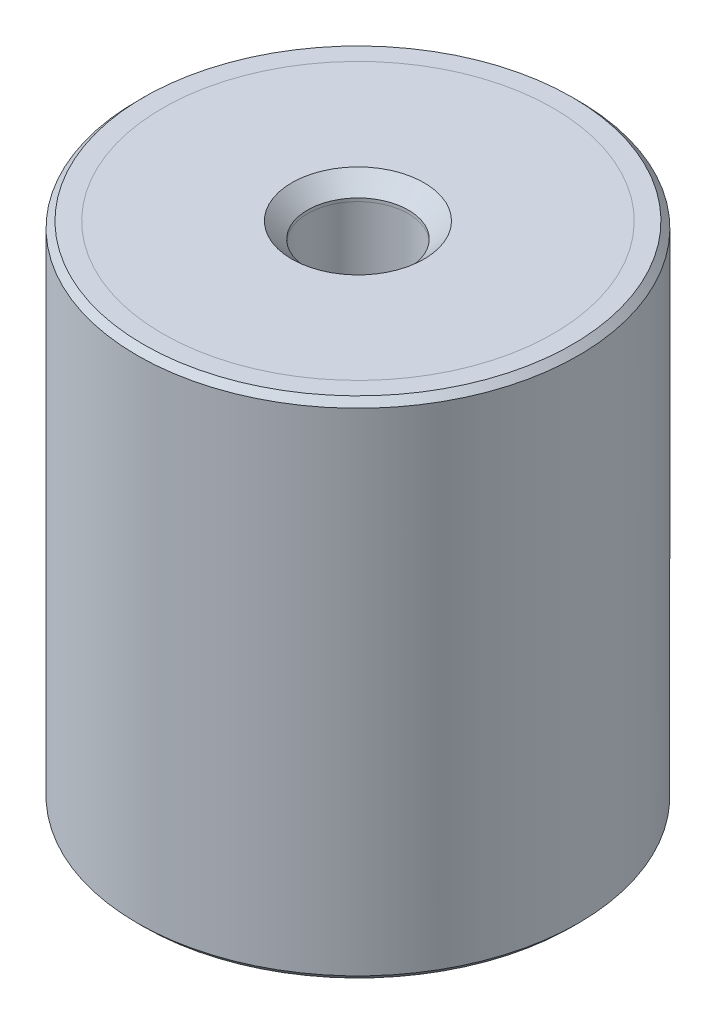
ISO-10303-21;
HEADER;
FILE_DESCRIPTION(('STEP AP214'),'2;1');
FILE_NAME('part.step','',(''),(''),'','','');
FILE_SCHEMA(('AUTOMOTIVE_DESIGN { 1 0 10303 214 1 1 1 1 }'));
ENDSEC;
DATA;
#1=APPLICATION_CONTEXT('core data for automotive mechanical design processes');
#2=APPLICATION_PROTOCOL_DEFINITION('international standard','automotive_design',2000,#1);
#3=PRODUCT_CONTEXT('',#1,'mechanical');
#4=PRODUCT('Part','Part','',(#3));
#5=PRODUCT_RELATED_PRODUCT_CATEGORY('part','',(#4));
#6=PRODUCT_DEFINITION_FORMATION('','',#4);
#7=PRODUCT_DEFINITION_CONTEXT('part definition',#1,'design');
#8=PRODUCT_DEFINITION('design','',#6,#7);
#9=PRODUCT_DEFINITION_SHAPE('','',#8);
#10=(LENGTH_UNIT() NAMED_UNIT(*) SI_UNIT(.MILLI.,.METRE.));
#11=(NAMED_UNIT(*) PLANE_ANGLE_UNIT() SI_UNIT($,.RADIAN.));
#12=(NAMED_UNIT(*) SI_UNIT($,.STERADIAN.) SOLID_ANGLE_UNIT());
#13=UNCERTAINTY_MEASURE_WITH_UNIT(LENGTH_MEASURE(1.E-05),#10,'distance_accuracy_value','');
#14=(GEOMETRIC_REPRESENTATION_CONTEXT(3) GLOBAL_UNCERTAINTY_ASSIGNED_CONTEXT((#13)) GLOBAL_UNIT_ASSIGNED_CONTEXT((#10,
#11,#12)) REPRESENTATION_CONTEXT('',''));
#15=CARTESIAN_POINT('',(0.,0.,0.));
#16=DIRECTION('',(0.,0.,1.));
#17=DIRECTION('',(1.,0.,0.));
#18=AXIS2_PLACEMENT_3D('',#15,#16,#17);
#19=CARTESIAN_POINT('',(0.,31.0340428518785,0.));
#20=DIRECTION('',(0.,1.,0.));
#21=DIRECTION('',(0.,0.,1.));
#22=AXIS2_PLACEMENT_3D('',#19,#20,#21);
#23=CYLINDRICAL_SURFACE('',#22,4.);
#24=CARTESIAN_POINT('',(0.,-37.25,0.));
#25=DIRECTION('',(0.,-1.,0.));
#26=DIRECTION('',(0.,0.,-1.));
#27=AXIS2_PLACEMENT_3D('',#24,#25,#26);
#28=CIRCLE('',#27,4.);
#29=CARTESIAN_POINT('',(0.,-37.25,-4.));
#30=VERTEX_POINT('',#29);
#31=EDGE_CURVE('P0_E10',#30,#30,#28,.T.);
#32=ORIENTED_EDGE('',*,*,#31,.T.);
#33=EDGE_LOOP('',(#32));
#34=FACE_BOUND('',#33,.T.);
#35=CARTESIAN_POINT('',(0.,-37.,0.));
#36=DIRECTION('',(0.,1.,0.));
#37=DIRECTION('',(0.,0.,1.));
#38=AXIS2_PLACEMENT_3D('',#35,#36,#37);
#39=CIRCLE('',#38,4.);
#40=CARTESIAN_POINT('',(0.,-37.,4.));
#41=VERTEX_POINT('',#40);
#42=EDGE_CURVE('P0_E25',#41,#41,#39,.T.);
#43=ORIENTED_EDGE('',*,*,#42,.T.);
#44=EDGE_LOOP('',(#43));
#45=FACE_BOUND('',#44,.T.);
#46=ADVANCED_FACE('P0_F14',(#34,#45),#23,.F.);
#47=CARTESIAN_POINT('',(0.,-37.,4.));
#48=DIRECTION('',(0.,1.,0.));
#49=DIRECTION('',(0.,0.,1.));
#50=AXIS2_PLACEMENT_3D('',#47,#48,#49);
#51=PLANE('',#50);
#52=CARTESIAN_POINT('',(0.,-37.,0.));
#53=DIRECTION('',(0.,1.,0.));
#54=DIRECTION('',(0.,0.,1.));
#55=AXIS2_PLACEMENT_3D('',#52,#53,#54);
#56=CIRCLE('',#55,15.5);
#57=CARTESIAN_POINT('',(0.,-37.,15.5));
#58=VERTEX_POINT('',#57);
#59=EDGE_CURVE('P0_E29',#58,#58,#56,.T.);
#60=ORIENTED_EDGE('',*,*,#59,.T.);
#61=EDGE_LOOP('',(#60));
#62=FACE_BOUND('',#61,.T.);
#63=ORIENTED_EDGE('',*,*,#42,.F.);
#64=EDGE_LOOP('',(#63));
#65=FACE_BOUND('',#64,.T.);
#66=ADVANCED_FACE('P0_F50',(#62,#65),#51,.T.);
#67=CARTESIAN_POINT('',(0.,31.0340428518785,0.));
#68=DIRECTION('',(0.,1.,0.));
#69=DIRECTION('',(0.,0.,1.));
#70=AXIS2_PLACEMENT_3D('',#67,#68,#69);
#71=CYLINDRICAL_SURFACE('',#70,15.5);
#72=CARTESIAN_POINT('',(0.,-38.5,0.));
#73=DIRECTION('',(0.,1.,0.));
#74=DIRECTION('',(0.,0.,1.));
#75=AXIS2_PLACEMENT_3D('',#72,#73,#74);
#76=CIRCLE('',#75,15.5);
#77=CARTESIAN_POINT('',(0.,-38.5,15.5));
#78=VERTEX_POINT('',#77);
#79=EDGE_CURVE('P0_E34',#78,#78,#76,.T.);
#80=ORIENTED_EDGE('',*,*,#79,.T.);
#81=EDGE_LOOP('',(#80));
#82=FACE_BOUND('',#81,.T.);
#83=ORIENTED_EDGE('',*,*,#59,.F.);
#84=EDGE_LOOP('',(#83));
#85=FACE_BOUND('',#84,.T.);
#86=ADVANCED_FACE('P0_F38',(#82,#85),#71,.T.);
#87=CARTESIAN_POINT('',(0.,-38.5,15.5));
#88=DIRECTION('',(0.,-1.,0.));
#89=DIRECTION('',(0.,0.,-1.));
#90=AXIS2_PLACEMENT_3D('',#87,#88,#89);
#91=PLANE('',#90);
#92=CARTESIAN_POINT('',(0.,-38.5,0.));
#93=DIRECTION('',(0.,-1.,0.));
#94=DIRECTION('',(0.,0.,-1.));
#95=AXIS2_PLACEMENT_3D('',#92,#93,#94);
#96=CIRCLE('',#95,5.25);
#97=CARTESIAN_POINT('',(0.,-38.5,-5.25));
#98=VERTEX_POINT('',#97);
#99=EDGE_CURVE('P0_E21',#98,#98,#96,.F.);
#100=ORIENTED_EDGE('',*,*,#99,.T.);
#101=EDGE_LOOP('',(#100));
#102=FACE_BOUND('',#101,.T.);
#103=ORIENTED_EDGE('',*,*,#79,.F.);
#104=EDGE_LOOP('',(#103));
#105=FACE_BOUND('',#104,.T.);
#106=ADVANCED_FACE('P0_F41',(#102,#105),#91,.T.);
#107=CARTESIAN_POINT('',(0.,-38.5,0.));
#108=DIRECTION('',(0.,-1.,0.));
#109=DIRECTION('',(0.,0.,-1.));
#110=AXIS2_PLACEMENT_3D('',#107,#108,#109);
#111=CONICAL_SURFACE('',#110,5.25,0.785398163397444);
#112=ORIENTED_EDGE('',*,*,#31,.F.);
#113=EDGE_LOOP('',(#112));
#114=FACE_BOUND('',#113,.T.);
#115=ORIENTED_EDGE('',*,*,#99,.F.);
#116=EDGE_LOOP('',(#115));
#117=FACE_BOUND('',#116,.T.);
#118=ADVANCED_FACE('P0_F16',(#114,#117),#111,.F.);
#119=CLOSED_SHELL('',(#46,#66,#86,#106,#118));
#120=MANIFOLD_SOLID_BREP('P0_B1',#119);
#121=CARTESIAN_POINT('',(0.,69.5340428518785,0.));
#122=DIRECTION('',(0.,1.,0.));
#123=DIRECTION('',(0.,0.,1.));
#124=AXIS2_PLACEMENT_3D('',#121,#122,#123);
#125=CYLINDRICAL_SURFACE('',#124,4.);
#126=CARTESIAN_POINT('',(0.,0.249999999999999,0.));
#127=DIRECTION('',(0.,1.,0.));
#128=DIRECTION('',(0.,0.,1.));
#129=AXIS2_PLACEMENT_3D('',#126,#127,#128);
#130=CIRCLE('',#129,4.);
#131=CARTESIAN_POINT('',(0.,0.249999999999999,4.));
#132=VERTEX_POINT('',#131);
#133=EDGE_CURVE('P1_E21',#132,#132,#130,.T.);
#134=ORIENTED_EDGE('',*,*,#133,.T.);
#135=EDGE_LOOP('',(#134));
#136=FACE_BOUND('',#135,.T.);
#137=CARTESIAN_POINT('',(0.,0.,0.));
#138=DIRECTION('',(0.,1.,0.));
#139=DIRECTION('',(0.,0.,1.));
#140=AXIS2_PLACEMENT_3D('',#137,#138,#139);
#141=CIRCLE('',#140,4.);
#142=CARTESIAN_POINT('',(0.,0.,4.));
#143=VERTEX_POINT('',#142);
#144=EDGE_CURVE('P1_E34',#143,#143,#141,.T.);
#145=ORIENTED_EDGE('',*,*,#144,.F.);
#146=EDGE_LOOP('',(#145));
#147=FACE_BOUND('',#146,.T.);
#148=ADVANCED_FACE('P1_F14',(#136,#147),#125,.F.);
#149=CARTESIAN_POINT('',(0.,1.5,4.));
#150=DIRECTION('',(0.,1.,0.));
#151=DIRECTION('',(0.,0.,1.));
#152=AXIS2_PLACEMENT_3D('',#149,#150,#151);
#153=PLANE('',#152);
#154=CARTESIAN_POINT('',(0.,1.5,0.));
#155=DIRECTION('',(0.,1.,0.));
#156=DIRECTION('',(0.,0.,1.));
#157=AXIS2_PLACEMENT_3D('',#154,#155,#156);
#158=CIRCLE('',#157,5.25000000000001);
#159=CARTESIAN_POINT('',(0.,1.5,5.25000000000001));
#160=VERTEX_POINT('',#159);
#161=EDGE_CURVE('P1_E10',#160,#160,#158,.F.);
#162=ORIENTED_EDGE('',*,*,#161,.T.);
#163=EDGE_LOOP('',(#162));
#164=FACE_BOUND('',#163,.T.);
#165=CARTESIAN_POINT('',(0.,1.5,0.));
#166=DIRECTION('',(0.,1.,0.));
#167=DIRECTION('',(0.,0.,1.));
#168=AXIS2_PLACEMENT_3D('',#165,#166,#167);
#169=CIRCLE('',#168,15.5);
#170=CARTESIAN_POINT('',(0.,1.5,15.5));
#171=VERTEX_POINT('',#170);
#172=EDGE_CURVE('P1_E25',#171,#171,#169,.T.);
#173=ORIENTED_EDGE('',*,*,#172,.T.);
#174=EDGE_LOOP('',(#173));
#175=FACE_BOUND('',#174,.T.);
#176=ADVANCED_FACE('P1_F42',(#164,#175),#153,.T.);
#177=CARTESIAN_POINT('',(0.,69.5340428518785,0.));
#178=DIRECTION('',(0.,1.,0.));
#179=DIRECTION('',(0.,0.,1.));
#180=AXIS2_PLACEMENT_3D('',#177,#178,#179);
#181=CYLINDRICAL_SURFACE('',#180,15.5);
#182=CARTESIAN_POINT('',(0.,0.,0.));
#183=DIRECTION('',(0.,1.,0.));
#184=DIRECTION('',(0.,0.,1.));
#185=AXIS2_PLACEMENT_3D('',#182,#183,#184);
#186=CIRCLE('',#185,15.5);
#187=CARTESIAN_POINT('',(0.,0.,15.5));
#188=VERTEX_POINT('',#187);
#189=EDGE_CURVE('P1_E29',#188,#188,#186,.T.);
#190=ORIENTED_EDGE('',*,*,#189,.T.);
#191=EDGE_LOOP('',(#190));
#192=FACE_BOUND('',#191,.T.);
#193=ORIENTED_EDGE('',*,*,#172,.F.);
#194=EDGE_LOOP('',(#193));
#195=FACE_BOUND('',#194,.T.);
#196=ADVANCED_FACE('P1_F47',(#192,#195),#181,.T.);
#197=CARTESIAN_POINT('',(0.,0.,15.5));
#198=DIRECTION('',(0.,-1.,0.));
#199=DIRECTION('',(0.,0.,-1.));
#200=AXIS2_PLACEMENT_3D('',#197,#198,#199);
#201=PLANE('',#200);
#202=ORIENTED_EDGE('',*,*,#144,.T.);
#203=EDGE_LOOP('',(#202));
#204=FACE_BOUND('',#203,.T.);
#205=ORIENTED_EDGE('',*,*,#189,.F.);
#206=EDGE_LOOP('',(#205));
#207=FACE_BOUND('',#206,.T.);
#208=ADVANCED_FACE('P1_F38',(#204,#207),#201,.T.);
#209=CARTESIAN_POINT('',(0.,0.249999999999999,0.));
#210=DIRECTION('',(0.,1.,0.));
#211=DIRECTION('',(0.,0.,1.));
#212=AXIS2_PLACEMENT_3D('',#209,#210,#211);
#213=CONICAL_SURFACE('',#212,4.,0.785398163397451);
#214=ORIENTED_EDGE('',*,*,#161,.F.);
#215=EDGE_LOOP('',(#214));
#216=FACE_BOUND('',#215,.T.);
#217=ORIENTED_EDGE('',*,*,#133,.F.);
#218=EDGE_LOOP('',(#217));
#219=FACE_BOUND('',#218,.T.);
#220=ADVANCED_FACE('P1_F16',(#216,#219),#213,.F.);
#221=CLOSED_SHELL('',(#148,#176,#196,#208,#220));
#222=MANIFOLD_SOLID_BREP('P1_B1',#221);
#223=CARTESIAN_POINT('',(0.,0.,0.));
#224=DIRECTION('',(0.,1.,0.));
#225=DIRECTION('',(0.,0.,1.));
#226=AXIS2_PLACEMENT_3D('',#223,#224,#225);
#227=PLANE('',#226);
#228=CARTESIAN_POINT('',(0.,0.,0.));
#229=DIRECTION('',(0.,1.,0.));
#230=DIRECTION('',(0.,0.,1.));
#231=AXIS2_PLACEMENT_3D('',#228,#229,#230);
#232=CIRCLE('',#231,4.);
#233=CARTESIAN_POINT('',(0.,0.,4.));
#234=VERTEX_POINT('',#233);
#235=EDGE_CURVE('P2_E46',#234,#234,#232,.T.);
#236=ORIENTED_EDGE('',*,*,#235,.F.);
#237=EDGE_LOOP('',(#236));
#238=FACE_BOUND('',#237,.T.);
#239=CARTESIAN_POINT('',(0.,0.,0.));
#240=DIRECTION('',(0.,1.,0.));
#241=DIRECTION('',(0.,0.,1.));
#242=AXIS2_PLACEMENT_3D('',#239,#240,#241);
#243=CIRCLE('',#242,15.5);
#244=CARTESIAN_POINT('',(0.,0.,15.5));
#245=VERTEX_POINT('',#244);
#246=EDGE_CURVE('P2_E33',#245,#245,#243,.T.);
#247=ORIENTED_EDGE('',*,*,#246,.T.);
#248=EDGE_LOOP('',(#247));
#249=FACE_BOUND('',#248,.T.);
#250=ADVANCED_FACE('P2_F13',(#238,#249),#227,.T.);
#251=CARTESIAN_POINT('',(0.,65.5134936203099,0.));
#252=DIRECTION('',(0.,1.,0.));
#253=DIRECTION('',(0.,0.,1.));
#254=AXIS2_PLACEMENT_3D('',#251,#252,#253);
#255=CYLINDRICAL_SURFACE('',#254,15.5);
#256=CARTESIAN_POINT('',(0.,1.5,0.));
#257=DIRECTION('',(0.,1.,0.));
#258=DIRECTION('',(0.,0.,1.));
#259=AXIS2_PLACEMENT_3D('',#256,#257,#258);
#260=CIRCLE('',#259,15.5);
#261=CARTESIAN_POINT('',(0.,1.5,15.5));
#262=VERTEX_POINT('',#261);
#263=EDGE_CURVE('P2_E36',#262,#262,#260,.T.);
#264=ORIENTED_EDGE('',*,*,#263,.T.);
#265=EDGE_LOOP('',(#264));
#266=FACE_BOUND('',#265,.T.);
#267=ORIENTED_EDGE('',*,*,#246,.F.);
#268=EDGE_LOOP('',(#267));
#269=FACE_BOUND('',#268,.T.);
#270=ADVANCED_FACE('P2_F92',(#266,#269),#255,.F.);
#271=CARTESIAN_POINT('',(0.,1.5,15.5));
#272=DIRECTION('',(0.,1.,0.));
#273=DIRECTION('',(0.,0.,1.));
#274=AXIS2_PLACEMENT_3D('',#271,#272,#273);
#275=PLANE('',#274);
#276=CARTESIAN_POINT('',(0.,1.5,0.));
#277=DIRECTION('',(0.,1.,0.));
#278=DIRECTION('',(0.,0.,1.));
#279=AXIS2_PLACEMENT_3D('',#276,#277,#278);
#280=CIRCLE('',#279,17.);
#281=CARTESIAN_POINT('',(0.,1.5,17.));
#282=VERTEX_POINT('',#281);
#283=EDGE_CURVE('P2_E9',#282,#282,#280,.T.);
#284=ORIENTED_EDGE('',*,*,#283,.T.);
#285=EDGE_LOOP('',(#284));
#286=FACE_BOUND('',#285,.T.);
#287=ORIENTED_EDGE('',*,*,#263,.F.);
#288=EDGE_LOOP('',(#287));
#289=FACE_BOUND('',#288,.T.);
#290=ADVANCED_FACE('P2_F88',(#286,#289),#275,.T.);
#291=CARTESIAN_POINT('',(0.,65.5134936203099,0.));
#292=DIRECTION('',(0.,1.,0.));
#293=DIRECTION('',(0.,0.,1.));
#294=AXIS2_PLACEMENT_3D('',#291,#292,#293);
#295=CYLINDRICAL_SURFACE('',#294,17.5);
#296=CARTESIAN_POINT('',(0.,-38.,0.));
#297=DIRECTION('',(0.,-1.,0.));
#298=DIRECTION('',(0.,0.,-1.));
#299=AXIS2_PLACEMENT_3D('',#296,#297,#298);
#300=CIRCLE('',#299,17.5);
#301=CARTESIAN_POINT('',(0.,-38.,-17.5));
#302=VERTEX_POINT('',#301);
#303=EDGE_CURVE('P2_E24',#302,#302,#300,.F.);
#304=ORIENTED_EDGE('',*,*,#303,.T.);
#305=EDGE_LOOP('',(#304));
#306=FACE_BOUND('',#305,.T.);
#307=CARTESIAN_POINT('',(0.,1.,0.));
#308=DIRECTION('',(0.,1.,0.));
#309=DIRECTION('',(0.,0.,1.));
#310=AXIS2_PLACEMENT_3D('',#307,#308,#309);
#311=CIRCLE('',#310,17.5);
#312=CARTESIAN_POINT('',(0.,1.,17.5));
#313=VERTEX_POINT('',#312);
#314=EDGE_CURVE('P2_E28',#313,#313,#311,.F.);
#315=ORIENTED_EDGE('',*,*,#314,.T.);
#316=EDGE_LOOP('',(#315));
#317=FACE_BOUND('',#316,.T.);
#318=ADVANCED_FACE('P2_F82',(#306,#317),#295,.T.);
#319=CARTESIAN_POINT('',(0.,-38.5,17.5));
#320=DIRECTION('',(0.,-1.,0.));
#321=DIRECTION('',(0.,0.,-1.));
#322=AXIS2_PLACEMENT_3D('',#319,#320,#321);
#323=PLANE('',#322);
#324=CARTESIAN_POINT('',(0.,-38.5,0.));
#325=DIRECTION('',(0.,-1.,0.));
#326=DIRECTION('',(0.,0.,-1.));
#327=AXIS2_PLACEMENT_3D('',#324,#325,#326);
#328=CIRCLE('',#327,17.);
#329=CARTESIAN_POINT('',(0.,-38.5,-17.));
#330=VERTEX_POINT('',#329);
#331=EDGE_CURVE('P2_E20',#330,#330,#328,.T.);
#332=ORIENTED_EDGE('',*,*,#331,.T.);
#333=EDGE_LOOP('',(#332));
#334=FACE_BOUND('',#333,.T.);
#335=CARTESIAN_POINT('',(0.,-38.5,0.));
#336=DIRECTION('',(0.,1.,0.));
#337=DIRECTION('',(0.,0.,1.));
#338=AXIS2_PLACEMENT_3D('',#335,#336,#337);
#339=CIRCLE('',#338,15.5);
#340=CARTESIAN_POINT('',(0.,-38.5,15.5));
#341=VERTEX_POINT('',#340);
#342=EDGE_CURVE('P2_E39',#341,#341,#339,.T.);
#343=ORIENTED_EDGE('',*,*,#342,.T.);
#344=EDGE_LOOP('',(#343));
#345=FACE_BOUND('',#344,.T.);
#346=ADVANCED_FACE('P2_F77',(#334,#345),#323,.T.);
#347=CARTESIAN_POINT('',(0.,65.5134936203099,0.));
#348=DIRECTION('',(0.,1.,0.));
#349=DIRECTION('',(0.,0.,1.));
#350=AXIS2_PLACEMENT_3D('',#347,#348,#349);
#351=CYLINDRICAL_SURFACE('',#350,15.5);
#352=CARTESIAN_POINT('',(0.,-37.,0.));
#353=DIRECTION('',(0.,1.,0.));
#354=DIRECTION('',(0.,0.,1.));
#355=AXIS2_PLACEMENT_3D('',#352,#353,#354);
#356=CIRCLE('',#355,15.5);
#357=CARTESIAN_POINT('',(0.,-37.,15.5));
#358=VERTEX_POINT('',#357);
#359=EDGE_CURVE('P2_E42',#358,#358,#356,.T.);
#360=ORIENTED_EDGE('',*,*,#359,.T.);
#361=EDGE_LOOP('',(#360));
#362=FACE_BOUND('',#361,.T.);
#363=ORIENTED_EDGE('',*,*,#342,.F.);
#364=EDGE_LOOP('',(#363));
#365=FACE_BOUND('',#364,.T.);
#366=ADVANCED_FACE('P2_F71',(#362,#365),#351,.F.);
#367=CARTESIAN_POINT('',(0.,-37.,15.5));
#368=DIRECTION('',(0.,-1.,0.));
#369=DIRECTION('',(0.,0.,-1.));
#370=AXIS2_PLACEMENT_3D('',#367,#368,#369);
#371=PLANE('',#370);
#372=CARTESIAN_POINT('',(0.,-37.,0.));
#373=DIRECTION('',(0.,-1.,0.));
#374=DIRECTION('',(0.,0.,-1.));
#375=AXIS2_PLACEMENT_3D('',#372,#373,#374);
#376=CIRCLE('',#375,4.);
#377=CARTESIAN_POINT('',(0.,-37.,-4.));
#378=VERTEX_POINT('',#377);
#379=EDGE_CURVE('P2_E52',#378,#378,#376,.T.);
#380=ORIENTED_EDGE('',*,*,#379,.F.);
#381=EDGE_LOOP('',(#380));
#382=FACE_BOUND('',#381,.T.);
#383=ORIENTED_EDGE('',*,*,#359,.F.);
#384=EDGE_LOOP('',(#383));
#385=FACE_BOUND('',#384,.T.);
#386=ADVANCED_FACE('P2_F67',(#382,#385),#371,.T.);
#387=CARTESIAN_POINT('',(0.,-38.,0.));
#388=DIRECTION('',(0.,1.,0.));
#389=DIRECTION('',(0.,0.,1.));
#390=AXIS2_PLACEMENT_3D('',#387,#388,#389);
#391=CONICAL_SURFACE('',#390,17.5,0.785398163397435);
#392=ORIENTED_EDGE('',*,*,#331,.F.);
#393=EDGE_LOOP('',(#392));
#394=FACE_BOUND('',#393,.T.);
#395=ORIENTED_EDGE('',*,*,#303,.F.);
#396=EDGE_LOOP('',(#395));
#397=FACE_BOUND('',#396,.T.);
#398=ADVANCED_FACE('P2_F70',(#394,#397),#391,.T.);
#399=CARTESIAN_POINT('',(0.,1.5,0.));
#400=DIRECTION('',(0.,-1.,0.));
#401=DIRECTION('',(0.,0.,-1.));
#402=AXIS2_PLACEMENT_3D('',#399,#400,#401);
#403=CONICAL_SURFACE('',#402,17.,0.785398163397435);
#404=ORIENTED_EDGE('',*,*,#314,.F.);
#405=EDGE_LOOP('',(#404));
#406=FACE_BOUND('',#405,.T.);
#407=ORIENTED_EDGE('',*,*,#283,.F.);
#408=EDGE_LOOP('',(#407));
#409=FACE_BOUND('',#408,.T.);
#410=ADVANCED_FACE('P2_F15',(#406,#409),#403,.T.);
#411=CARTESIAN_POINT('',(0.,-6.5,0.));
#412=DIRECTION('',(0.,1.,0.));
#413=DIRECTION('',(0.,0.,1.));
#414=AXIS2_PLACEMENT_3D('',#411,#412,#413);
#415=CYLINDRICAL_SURFACE('',#414,4.);
#416=CARTESIAN_POINT('',(0.,-6.5,0.));
#417=DIRECTION('',(0.,1.,0.));
#418=DIRECTION('',(0.,0.,1.));
#419=AXIS2_PLACEMENT_3D('',#416,#417,#418);
#420=CIRCLE('',#419,4.);
#421=CARTESIAN_POINT('',(0.,-6.5,4.));
#422=VERTEX_POINT('',#421);
#423=EDGE_CURVE('P2_E45',#422,#422,#420,.T.);
#424=CARTESIAN_POINT('',(0.,-6.5,4.));
#425=CARTESIAN_POINT('',(0.,-6.43229166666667,4.));
#426=CARTESIAN_POINT('',(0.,-6.36458333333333,4.));
#427=CARTESIAN_POINT('',(0.,-6.22916666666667,4.));
#428=CARTESIAN_POINT('',(0.,-6.16145833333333,4.));
#429=CARTESIAN_POINT('',(0.,-6.02604166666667,4.));
#430=CARTESIAN_POINT('',(0.,-5.95833333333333,4.));
#431=CARTESIAN_POINT('',(0.,-5.82291666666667,4.));
#432=CARTESIAN_POINT('',(0.,-5.75520833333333,4.));
#433=CARTESIAN_POINT('',(0.,-5.61979166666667,4.));
#434=CARTESIAN_POINT('',(0.,-5.55208333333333,4.));
#435=CARTESIAN_POINT('',(0.,-5.41666666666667,4.));
#436=CARTESIAN_POINT('',(0.,-5.34895833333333,4.));
#437=CARTESIAN_POINT('',(0.,-5.21354166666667,4.));
#438=CARTESIAN_POINT('',(0.,-5.14583333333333,4.));
#439=CARTESIAN_POINT('',(0.,-5.01041666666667,4.));
#440=CARTESIAN_POINT('',(0.,-4.94270833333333,4.));
#441=CARTESIAN_POINT('',(0.,-4.80729166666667,4.));
#442=CARTESIAN_POINT('',(0.,-4.73958333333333,4.));
#443=CARTESIAN_POINT('',(0.,-4.60416666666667,4.));
#444=CARTESIAN_POINT('',(0.,-4.53645833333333,4.));
#445=CARTESIAN_POINT('',(0.,-4.40104166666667,4.));
#446=CARTESIAN_POINT('',(0.,-4.33333333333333,4.));
#447=CARTESIAN_POINT('',(0.,-4.19791666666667,4.));
#448=CARTESIAN_POINT('',(0.,-4.13020833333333,4.));
#449=CARTESIAN_POINT('',(0.,-3.99479166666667,4.));
#450=CARTESIAN_POINT('',(0.,-3.92708333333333,4.));
#451=CARTESIAN_POINT('',(0.,-3.79166666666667,4.));
#452=CARTESIAN_POINT('',(0.,-3.72395833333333,4.));
#453=CARTESIAN_POINT('',(0.,-3.58854166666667,4.));
#454=CARTESIAN_POINT('',(0.,-3.52083333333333,4.));
#455=CARTESIAN_POINT('',(0.,-3.38541666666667,4.));
#456=CARTESIAN_POINT('',(0.,-3.31770833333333,4.));
#457=CARTESIAN_POINT('',(0.,-3.18229166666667,4.));
#458=CARTESIAN_POINT('',(0.,-3.11458333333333,4.));
#459=CARTESIAN_POINT('',(0.,-2.97916666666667,4.));
#460=CARTESIAN_POINT('',(0.,-2.91145833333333,4.));
#461=CARTESIAN_POINT('',(0.,-2.77604166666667,4.));
#462=CARTESIAN_POINT('',(0.,-2.70833333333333,4.));
#463=CARTESIAN_POINT('',(0.,-2.57291666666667,4.));
#464=CARTESIAN_POINT('',(0.,-2.50520833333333,4.));
#465=CARTESIAN_POINT('',(0.,-2.36979166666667,4.));
#466=CARTESIAN_POINT('',(0.,-2.30208333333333,4.));
#467=CARTESIAN_POINT('',(0.,-2.16666666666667,4.));
#468=CARTESIAN_POINT('',(0.,-2.09895833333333,4.));
#469=CARTESIAN_POINT('',(0.,-1.96354166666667,4.));
#470=CARTESIAN_POINT('',(0.,-1.89583333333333,4.));
#471=CARTESIAN_POINT('',(0.,-1.76041666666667,4.));
#472=CARTESIAN_POINT('',(0.,-1.69270833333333,4.));
#473=CARTESIAN_POINT('',(0.,-1.55729166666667,4.));
#474=CARTESIAN_POINT('',(0.,-1.48958333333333,4.));
#475=CARTESIAN_POINT('',(0.,-1.35416666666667,4.));
#476=CARTESIAN_POINT('',(0.,-1.28645833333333,4.));
#477=CARTESIAN_POINT('',(0.,-1.15104166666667,4.));
#478=CARTESIAN_POINT('',(0.,-1.08333333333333,4.));
#479=CARTESIAN_POINT('',(0.,-0.947916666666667,4.));
#480=CARTESIAN_POINT('',(0.,-0.880208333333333,4.));
#481=CARTESIAN_POINT('',(0.,-0.744791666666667,4.));
#482=CARTESIAN_POINT('',(0.,-0.677083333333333,4.));
#483=CARTESIAN_POINT('',(0.,-0.541666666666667,4.));
#484=CARTESIAN_POINT('',(0.,-0.473958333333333,4.));
#485=CARTESIAN_POINT('',(0.,-0.338541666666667,4.));
#486=CARTESIAN_POINT('',(0.,-0.270833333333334,4.));
#487=CARTESIAN_POINT('',(0.,-0.135416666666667,4.));
#488=CARTESIAN_POINT('',(0.,-0.0677083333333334,4.));
#489=CARTESIAN_POINT('',(0.,0.,4.));
#490=B_SPLINE_CURVE_WITH_KNOTS('',3,(#424,#425,#426,#427,#428,#429,#430,#431,#432,#433,#434,
#435,#436,#437,#438,#439,#440,#441,#442,#443,#444,#445,#446,#447,#448,#449,#450,#451,#452,#453,
#454,#455,#456,#457,#458,#459,#460,#461,#462,#463,#464,#465,#466,#467,#468,#469,#470,#471,#472,
#473,#474,#475,#476,#477,#478,#479,#480,#481,#482,#483,#484,#485,#486,#487,#488,#489),
.UNSPECIFIED.,.F.,.F.,(4,2,2,2,2,2,2,2,2,2,2,2,2,2,2,2,2,2,2,2,2,2,2,2,2,2,2,2,2,2,2,2,4),(0.,
0.203124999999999,0.40625,0.609375,0.8125,1.015625,1.21875,1.421875,1.625,1.828125,2.03125,
2.234375,2.4375,2.640625,2.84375,3.046875,3.25,3.453125,3.65625,3.859375,4.0625,4.265625,
4.46875,4.671875,4.875,5.078125,5.28125,5.484375,5.6875,5.890625,6.09375,6.296875,6.5),.UNSPECIFIED.);
#491=EDGE_CURVE('P2_BSEAM108',#422,#234,#490,.T.);
#492=ORIENTED_EDGE('',*,*,#423,.F.);
#493=ORIENTED_EDGE('',*,*,#235,.T.);
#494=ORIENTED_EDGE('',*,*,#491,.T.);
#495=ORIENTED_EDGE('',*,*,#491,.F.);
#496=EDGE_LOOP('',(#492,#494,#493,#495));
#497=FACE_BOUND('',#496,.T.);
#498=ADVANCED_FACE('P2_F108',(#497),#415,.F.);
#499=CARTESIAN_POINT('',(0.,-6.5,0.));
#500=DIRECTION('',(0.,1.,0.));
#501=DIRECTION('',(0.,0.,1.));
#502=AXIS2_PLACEMENT_3D('',#499,#500,#501);
#503=PLANE('',#502);
#504=ORIENTED_EDGE('',*,*,#423,.T.);
#505=EDGE_LOOP('',(#504));
#506=FACE_BOUND('',#505,.T.);
#507=ADVANCED_FACE('P2_F63',(#506),#503,.T.);
#508=CARTESIAN_POINT('',(0.,-30.5,0.));
#509=DIRECTION('',(0.,-1.,0.));
#510=DIRECTION('',(0.,0.,-1.));
#511=AXIS2_PLACEMENT_3D('',#508,#509,#510);
#512=CYLINDRICAL_SURFACE('',#511,4.);
#513=CARTESIAN_POINT('',(0.,-30.5,0.));
#514=DIRECTION('',(0.,-1.,0.));
#515=DIRECTION('',(0.,0.,-1.));
#516=AXIS2_PLACEMENT_3D('',#513,#514,#515);
#517=CIRCLE('',#516,4.);
#518=CARTESIAN_POINT('',(0.,-30.5,-4.));
#519=VERTEX_POINT('',#518);
#520=EDGE_CURVE('P2_E49',#519,#519,#517,.T.);
#521=CARTESIAN_POINT('',(0.,-30.5,-4.));
#522=CARTESIAN_POINT('',(0.,-30.5677083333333,-4.));
#523=CARTESIAN_POINT('',(0.,-30.6354166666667,-4.));
#524=CARTESIAN_POINT('',(0.,-30.7708333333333,-4.));
#525=CARTESIAN_POINT('',(0.,-30.8385416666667,-4.));
#526=CARTESIAN_POINT('',(0.,-30.9739583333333,-4.));
#527=CARTESIAN_POINT('',(0.,-31.0416666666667,-4.));
#528=CARTESIAN_POINT('',(0.,-31.1770833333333,-4.));
#529=CARTESIAN_POINT('',(0.,-31.2447916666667,-4.));
#530=CARTESIAN_POINT('',(0.,-31.3802083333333,-4.));
#531=CARTESIAN_POINT('',(0.,-31.4479166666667,-4.));
#532=CARTESIAN_POINT('',(0.,-31.5833333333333,-4.));
#533=CARTESIAN_POINT('',(0.,-31.6510416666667,-4.));
#534=CARTESIAN_POINT('',(0.,-31.7864583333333,-4.));
#535=CARTESIAN_POINT('',(0.,-31.8541666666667,-4.));
#536=CARTESIAN_POINT('',(0.,-31.9895833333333,-4.));
#537=CARTESIAN_POINT('',(0.,-32.0572916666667,-4.));
#538=CARTESIAN_POINT('',(0.,-32.1927083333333,-4.));
#539=CARTESIAN_POINT('',(0.,-32.2604166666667,-4.));
#540=CARTESIAN_POINT('',(0.,-32.3958333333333,-4.));
#541=CARTESIAN_POINT('',(0.,-32.4635416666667,-4.));
#542=CARTESIAN_POINT('',(0.,-32.5989583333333,-4.));
#543=CARTESIAN_POINT('',(0.,-32.6666666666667,-4.));
#544=CARTESIAN_POINT('',(0.,-32.8020833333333,-4.));
#545=CARTESIAN_POINT('',(0.,-32.8697916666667,-4.));
#546=CARTESIAN_POINT('',(0.,-33.0052083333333,-4.));
#547=CARTESIAN_POINT('',(0.,-33.0729166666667,-4.));
#548=CARTESIAN_POINT('',(0.,-33.2083333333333,-4.));
#549=CARTESIAN_POINT('',(0.,-33.2760416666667,-4.));
#550=CARTESIAN_POINT('',(0.,-33.4114583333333,-4.));
#551=CARTESIAN_POINT('',(0.,-33.4791666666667,-4.));
#552=CARTESIAN_POINT('',(0.,-33.6145833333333,-4.));
#553=CARTESIAN_POINT('',(0.,-33.6822916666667,-4.));
#554=CARTESIAN_POINT('',(0.,-33.8177083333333,-4.));
#555=CARTESIAN_POINT('',(0.,-33.8854166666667,-4.));
#556=CARTESIAN_POINT('',(0.,-34.0208333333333,-4.));
#557=CARTESIAN_POINT('',(0.,-34.0885416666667,-4.));
#558=CARTESIAN_POINT('',(0.,-34.2239583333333,-4.));
#559=CARTESIAN_POINT('',(0.,-34.2916666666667,-4.));
#560=CARTESIAN_POINT('',(0.,-34.4270833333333,-4.));
#561=CARTESIAN_POINT('',(0.,-34.4947916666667,-4.));
#562=CARTESIAN_POINT('',(0.,-34.6302083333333,-4.));
#563=CARTESIAN_POINT('',(0.,-34.6979166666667,-4.));
#564=CARTESIAN_POINT('',(0.,-34.8333333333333,-4.));
#565=CARTESIAN_POINT('',(0.,-34.9010416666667,-4.));
#566=CARTESIAN_POINT('',(0.,-35.0364583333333,-4.));
#567=CARTESIAN_POINT('',(0.,-35.1041666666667,-4.));
#568=CARTESIAN_POINT('',(0.,-35.2395833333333,-4.));
#569=CARTESIAN_POINT('',(0.,-35.3072916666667,-4.));
#570=CARTESIAN_POINT('',(0.,-35.4427083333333,-4.));
#571=CARTESIAN_POINT('',(0.,-35.5104166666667,-4.));
#572=CARTESIAN_POINT('',(0.,-35.6458333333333,-4.));
#573=CARTESIAN_POINT('',(0.,-35.7135416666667,-4.));
#574=CARTESIAN_POINT('',(0.,-35.8489583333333,-4.));
#575=CARTESIAN_POINT('',(0.,-35.9166666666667,-4.));
#576=CARTESIAN_POINT('',(0.,-36.0520833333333,-4.));
#577=CARTESIAN_POINT('',(0.,-36.1197916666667,-4.));
#578=CARTESIAN_POINT('',(0.,-36.2552083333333,-4.));
#579=CARTESIAN_POINT('',(0.,-36.3229166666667,-4.));
#580=CARTESIAN_POINT('',(0.,-36.4583333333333,-4.));
#581=CARTESIAN_POINT('',(0.,-36.5260416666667,-4.));
#582=CARTESIAN_POINT('',(0.,-36.6614583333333,-4.));
#583=CARTESIAN_POINT('',(0.,-36.7291666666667,-4.));
#584=CARTESIAN_POINT('',(0.,-36.8645833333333,-4.));
#585=CARTESIAN_POINT('',(0.,-36.9322916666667,-4.));
#586=CARTESIAN_POINT('',(0.,-37.,-4.));
#587=B_SPLINE_CURVE_WITH_KNOTS('',3,(#521,#522,#523,#524,#525,#526,#527,#528,#529,#530,#531,
#532,#533,#534,#535,#536,#537,#538,#539,#540,#541,#542,#543,#544,#545,#546,#547,#548,#549,#550,
#551,#552,#553,#554,#555,#556,#557,#558,#559,#560,#561,#562,#563,#564,#565,#566,#567,#568,#569,
#570,#571,#572,#573,#574,#575,#576,#577,#578,#579,#580,#581,#582,#583,#584,#585,#586),
.UNSPECIFIED.,.F.,.F.,(4,2,2,2,2,2,2,2,2,2,2,2,2,2,2,2,2,2,2,2,2,2,2,2,2,2,2,2,2,2,2,2,4),(0.,
0.203124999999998,0.406249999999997,0.609374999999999,0.812500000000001,1.015625,1.21875,
1.421875,1.62499999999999,1.828125,2.03125,2.234375,2.4375,2.64062499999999,2.84375,3.046875,
3.25,3.45312499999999,3.65624999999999,3.859375,4.0625,4.26562499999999,4.46874999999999,
4.671875,4.875,5.078125,5.28124999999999,5.48437499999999,5.68749999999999,5.890625,
6.09374999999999,6.29687499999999,6.49999999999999),.UNSPECIFIED.);
#588=EDGE_CURVE('P2_BSEAM60',#519,#378,#587,.T.);
#589=ORIENTED_EDGE('',*,*,#520,.F.);
#590=ORIENTED_EDGE('',*,*,#379,.T.);
#591=ORIENTED_EDGE('',*,*,#588,.T.);
#592=ORIENTED_EDGE('',*,*,#588,.F.);
#593=EDGE_LOOP('',(#589,#591,#590,#592));
#594=FACE_BOUND('',#593,.T.);
#595=ADVANCED_FACE('P2_F60',(#594),#512,.F.);
#596=CARTESIAN_POINT('',(0.,-30.5,0.));
#597=DIRECTION('',(0.,-1.,0.));
#598=DIRECTION('',(0.,0.,-1.));
#599=AXIS2_PLACEMENT_3D('',#596,#597,#598);
#600=PLANE('',#599);
#601=ORIENTED_EDGE('',*,*,#520,.T.);
#602=EDGE_LOOP('',(#601));
#603=FACE_BOUND('',#602,.T.);
#604=ADVANCED_FACE('P2_F58',(#603),#600,.T.);
#605=CLOSED_SHELL('',(#250,#270,#290,#318,#346,#366,#386,#398,#410,#498,#507,#595,#604));
#606=MANIFOLD_SOLID_BREP('P2_B1',#605);
#607=ADVANCED_BREP_SHAPE_REPRESENTATION('',(#18,#120,#222,#606),#14);
#608=SHAPE_DEFINITION_REPRESENTATION(#9,#607);
ENDSEC;
END-ISO-10303-21;
